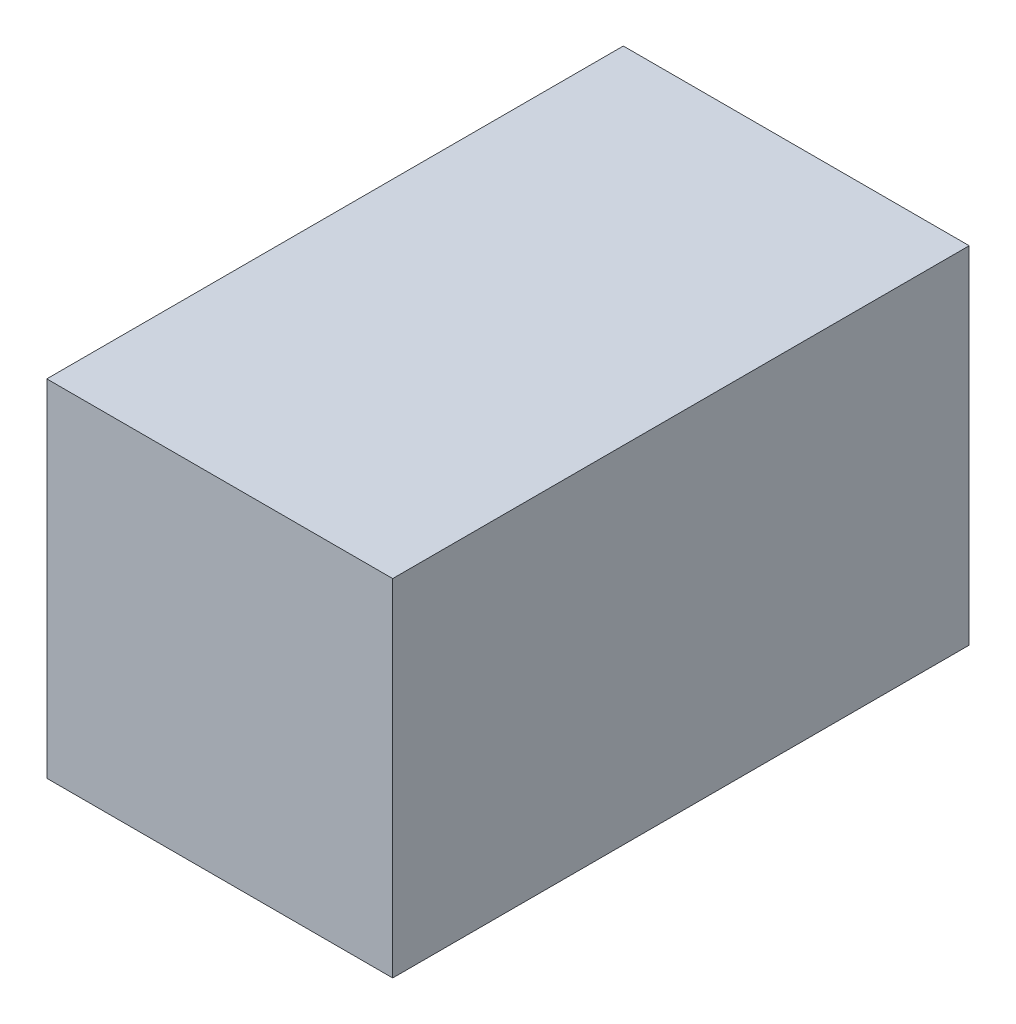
ISO-10303-21;
HEADER;
FILE_DESCRIPTION(('STEP AP214'),'2;1');
FILE_NAME('part.step','',(''),(''),'','','');
FILE_SCHEMA(('AUTOMOTIVE_DESIGN { 1 0 10303 214 1 1 1 1 }'));
ENDSEC;
DATA;
#1=APPLICATION_CONTEXT('core data for automotive mechanical design processes');
#2=APPLICATION_PROTOCOL_DEFINITION('international standard','automotive_design',2000,#1);
#3=PRODUCT_CONTEXT('',#1,'mechanical');
#4=PRODUCT('Part','Part','',(#3));
#5=PRODUCT_RELATED_PRODUCT_CATEGORY('part','',(#4));
#6=PRODUCT_DEFINITION_FORMATION('','',#4);
#7=PRODUCT_DEFINITION_CONTEXT('part definition',#1,'design');
#8=PRODUCT_DEFINITION('design','',#6,#7);
#9=PRODUCT_DEFINITION_SHAPE('','',#8);
#10=(LENGTH_UNIT() NAMED_UNIT(*) SI_UNIT(.MILLI.,.METRE.));
#11=(NAMED_UNIT(*) PLANE_ANGLE_UNIT() SI_UNIT($,.RADIAN.));
#12=(NAMED_UNIT(*) SI_UNIT($,.STERADIAN.) SOLID_ANGLE_UNIT());
#13=UNCERTAINTY_MEASURE_WITH_UNIT(LENGTH_MEASURE(1.E-05),#10,'distance_accuracy_value','');
#14=(GEOMETRIC_REPRESENTATION_CONTEXT(3) GLOBAL_UNCERTAINTY_ASSIGNED_CONTEXT((#13)) GLOBAL_UNIT_ASSIGNED_CONTEXT((#10,
#11,#12)) REPRESENTATION_CONTEXT('',''));
#15=CARTESIAN_POINT('',(0.,0.,0.));
#16=DIRECTION('',(0.,0.,1.));
#17=DIRECTION('',(1.,0.,0.));
#18=AXIS2_PLACEMENT_3D('',#15,#16,#17);
#19=CARTESIAN_POINT('',(0.,0.,100.));
#20=DIRECTION('',(1.,0.,0.));
#21=DIRECTION('',(0.,1.,0.));
#22=AXIS2_PLACEMENT_3D('',#19,#20,#21);
#23=PLANE('',#22);
#24=DIRECTION('',(0.,-1.,0.));
#25=VECTOR('',#24,1.);
#26=CARTESIAN_POINT('',(0.,0.,0.));
#27=LINE('',#26,#25);
#28=CARTESIAN_POINT('',(0.,59.9999999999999,0.));
#29=VERTEX_POINT('',#28);
#30=CARTESIAN_POINT('',(0.,0.,0.));
#31=VERTEX_POINT('',#30);
#32=EDGE_CURVE('E81',#29,#31,#27,.T.);
#33=ORIENTED_EDGE('',*,*,#32,.T.);
#34=DIRECTION('',(0.,0.,-1.));
#35=VECTOR('',#34,1.);
#36=CARTESIAN_POINT('',(0.,0.,100.));
#37=LINE('',#36,#35);
#38=CARTESIAN_POINT('',(0.,0.,100.));
#39=VERTEX_POINT('',#38);
#40=EDGE_CURVE('E11',#39,#31,#37,.T.);
#41=ORIENTED_EDGE('',*,*,#40,.F.);
#42=DIRECTION('',(0.,-1.,0.));
#43=VECTOR('',#42,1.);
#44=CARTESIAN_POINT('',(0.,0.,100.));
#45=LINE('',#44,#43);
#46=CARTESIAN_POINT('',(0.,59.9999999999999,100.));
#47=VERTEX_POINT('',#46);
#48=EDGE_CURVE('E100',#47,#39,#45,.T.);
#49=ORIENTED_EDGE('',*,*,#48,.F.);
#50=DIRECTION('',(0.,0.,-1.));
#51=VECTOR('',#50,1.);
#52=CARTESIAN_POINT('',(0.,59.9999999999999,100.));
#53=LINE('',#52,#51);
#54=EDGE_CURVE('E93',#47,#29,#53,.T.);
#55=ORIENTED_EDGE('',*,*,#54,.T.);
#56=EDGE_LOOP('',(#33,#41,#49,#55));
#57=FACE_BOUND('',#56,.T.);
#58=ADVANCED_FACE('F36',(#57),#23,.F.);
#59=CARTESIAN_POINT('',(0.,0.,100.));
#60=DIRECTION('',(0.,1.,0.));
#61=DIRECTION('',(0.,0.,1.));
#62=AXIS2_PLACEMENT_3D('',#59,#60,#61);
#63=PLANE('',#62);
#64=DIRECTION('',(1.,0.,0.));
#65=VECTOR('',#64,1.);
#66=CARTESIAN_POINT('',(0.,0.,0.));
#67=LINE('',#66,#65);
#68=CARTESIAN_POINT('',(60.0000000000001,0.,0.));
#69=VERTEX_POINT('',#68);
#70=EDGE_CURVE('E77',#31,#69,#67,.T.);
#71=ORIENTED_EDGE('',*,*,#70,.T.);
#72=DIRECTION('',(0.,0.,-1.));
#73=VECTOR('',#72,1.);
#74=CARTESIAN_POINT('',(60.0000000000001,0.,100.));
#75=LINE('',#74,#73);
#76=CARTESIAN_POINT('',(60.0000000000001,0.,100.));
#77=VERTEX_POINT('',#76);
#78=EDGE_CURVE('E44',#77,#69,#75,.T.);
#79=ORIENTED_EDGE('',*,*,#78,.F.);
#80=DIRECTION('',(1.,0.,0.));
#81=VECTOR('',#80,1.);
#82=CARTESIAN_POINT('',(0.,0.,100.));
#83=LINE('',#82,#81);
#84=EDGE_CURVE('E89',#39,#77,#83,.T.);
#85=ORIENTED_EDGE('',*,*,#84,.F.);
#86=ORIENTED_EDGE('',*,*,#40,.T.);
#87=EDGE_LOOP('',(#71,#79,#85,#86));
#88=FACE_BOUND('',#87,.T.);
#89=ADVANCED_FACE('F88',(#88),#63,.F.);
#90=CARTESIAN_POINT('',(60.0000000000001,0.,100.));
#91=DIRECTION('',(-1.,0.,0.));
#92=DIRECTION('',(0.,-1.,0.));
#93=AXIS2_PLACEMENT_3D('',#90,#91,#92);
#94=PLANE('',#93);
#95=DIRECTION('',(0.,1.,0.));
#96=VECTOR('',#95,1.);
#97=CARTESIAN_POINT('',(60.0000000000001,0.,0.));
#98=LINE('',#97,#96);
#99=CARTESIAN_POINT('',(60.0000000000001,59.9999999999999,0.));
#100=VERTEX_POINT('',#99);
#101=EDGE_CURVE('E82',#69,#100,#98,.T.);
#102=ORIENTED_EDGE('',*,*,#101,.T.);
#103=DIRECTION('',(0.,0.,-1.));
#104=VECTOR('',#103,1.);
#105=CARTESIAN_POINT('',(60.0000000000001,59.9999999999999,100.));
#106=LINE('',#105,#104);
#107=CARTESIAN_POINT('',(60.0000000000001,59.9999999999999,100.));
#108=VERTEX_POINT('',#107);
#109=EDGE_CURVE('E107',#108,#100,#106,.T.);
#110=ORIENTED_EDGE('',*,*,#109,.F.);
#111=DIRECTION('',(0.,1.,0.));
#112=VECTOR('',#111,1.);
#113=CARTESIAN_POINT('',(60.0000000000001,0.,100.));
#114=LINE('',#113,#112);
#115=EDGE_CURVE('E56',#77,#108,#114,.T.);
#116=ORIENTED_EDGE('',*,*,#115,.F.);
#117=ORIENTED_EDGE('',*,*,#78,.T.);
#118=EDGE_LOOP('',(#102,#110,#116,#117));
#119=FACE_BOUND('',#118,.T.);
#120=ADVANCED_FACE('F116',(#119),#94,.F.);
#121=CARTESIAN_POINT('',(0.,59.9999999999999,100.));
#122=DIRECTION('',(0.,-1.,0.));
#123=DIRECTION('',(0.,0.,-1.));
#124=AXIS2_PLACEMENT_3D('',#121,#122,#123);
#125=PLANE('',#124);
#126=DIRECTION('',(-1.,0.,0.));
#127=VECTOR('',#126,1.);
#128=CARTESIAN_POINT('',(0.,59.9999999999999,0.));
#129=LINE('',#128,#127);
#130=EDGE_CURVE('E97',#100,#29,#129,.T.);
#131=ORIENTED_EDGE('',*,*,#130,.T.);
#132=ORIENTED_EDGE('',*,*,#54,.F.);
#133=DIRECTION('',(-1.,0.,0.));
#134=VECTOR('',#133,1.);
#135=CARTESIAN_POINT('',(0.,59.9999999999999,100.));
#136=LINE('',#135,#134);
#137=EDGE_CURVE('E51',#108,#47,#136,.T.);
#138=ORIENTED_EDGE('',*,*,#137,.F.);
#139=ORIENTED_EDGE('',*,*,#109,.T.);
#140=EDGE_LOOP('',(#131,#132,#138,#139));
#141=FACE_BOUND('',#140,.T.);
#142=ADVANCED_FACE('F118',(#141),#125,.F.);
#143=CARTESIAN_POINT('',(0.,59.9999999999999,100.));
#144=DIRECTION('',(0.,0.,-1.));
#145=DIRECTION('',(-1.,0.,0.));
#146=AXIS2_PLACEMENT_3D('',#143,#144,#145);
#147=PLANE('',#146);
#148=ORIENTED_EDGE('',*,*,#48,.T.);
#149=ORIENTED_EDGE('',*,*,#84,.T.);
#150=ORIENTED_EDGE('',*,*,#115,.T.);
#151=ORIENTED_EDGE('',*,*,#137,.T.);
#152=EDGE_LOOP('',(#148,#149,#150,#151));
#153=FACE_BOUND('',#152,.T.);
#154=ADVANCED_FACE('F119',(#153),#147,.F.);
#155=CARTESIAN_POINT('',(0.,59.9999999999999,0.));
#156=DIRECTION('',(0.,0.,-1.));
#157=DIRECTION('',(-1.,0.,0.));
#158=AXIS2_PLACEMENT_3D('',#155,#156,#157);
#159=PLANE('',#158);
#160=ORIENTED_EDGE('',*,*,#32,.F.);
#161=ORIENTED_EDGE('',*,*,#130,.F.);
#162=ORIENTED_EDGE('',*,*,#101,.F.);
#163=ORIENTED_EDGE('',*,*,#70,.F.);
#164=EDGE_LOOP('',(#160,#161,#162,#163));
#165=FACE_BOUND('',#164,.T.);
#166=ADVANCED_FACE('F78',(#165),#159,.T.);
#167=CLOSED_SHELL('',(#58,#89,#120,#142,#154,#166));
#168=MANIFOLD_SOLID_BREP('B2',#167);
#169=ADVANCED_BREP_SHAPE_REPRESENTATION('',(#18,#168),#14);
#170=SHAPE_DEFINITION_REPRESENTATION(#9,#169);
ENDSEC;
END-ISO-10303-21;
